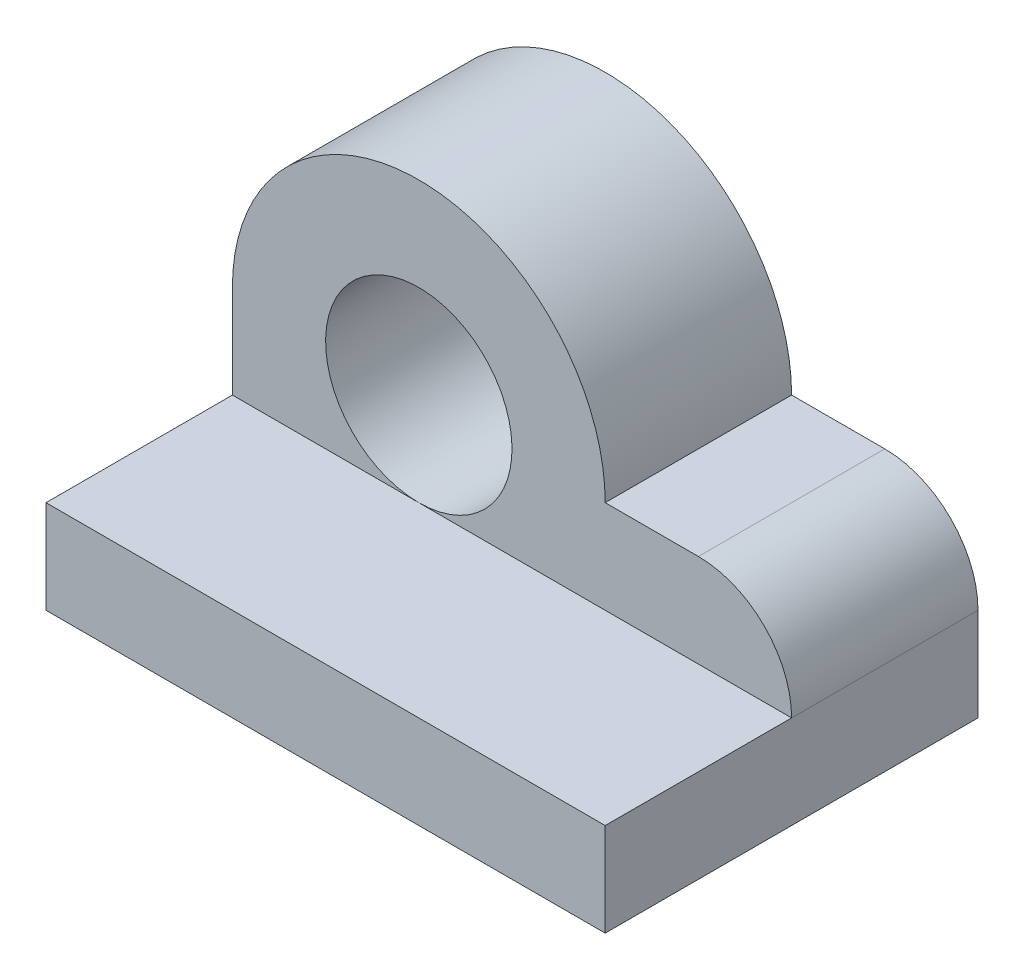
ISO-10303-21;
HEADER;
FILE_DESCRIPTION(('STEP AP214'),'2;1');
FILE_NAME('part.step','',(''),(''),'','','');
FILE_SCHEMA(('AUTOMOTIVE_DESIGN { 1 0 10303 214 1 1 1 1 }'));
ENDSEC;
DATA;
#1=APPLICATION_CONTEXT('core data for automotive mechanical design processes');
#2=APPLICATION_PROTOCOL_DEFINITION('international standard','automotive_design',2000,#1);
#3=PRODUCT_CONTEXT('',#1,'mechanical');
#4=PRODUCT('Part','Part','',(#3));
#5=PRODUCT_RELATED_PRODUCT_CATEGORY('part','',(#4));
#6=PRODUCT_DEFINITION_FORMATION('','',#4);
#7=PRODUCT_DEFINITION_CONTEXT('part definition',#1,'design');
#8=PRODUCT_DEFINITION('design','',#6,#7);
#9=PRODUCT_DEFINITION_SHAPE('','',#8);
#10=(LENGTH_UNIT() NAMED_UNIT(*) SI_UNIT(.MILLI.,.METRE.));
#11=(NAMED_UNIT(*) PLANE_ANGLE_UNIT() SI_UNIT($,.RADIAN.));
#12=(NAMED_UNIT(*) SI_UNIT($,.STERADIAN.) SOLID_ANGLE_UNIT());
#13=UNCERTAINTY_MEASURE_WITH_UNIT(LENGTH_MEASURE(1.E-05),#10,'distance_accuracy_value','');
#14=(GEOMETRIC_REPRESENTATION_CONTEXT(3) GLOBAL_UNCERTAINTY_ASSIGNED_CONTEXT((#13)) GLOBAL_UNIT_ASSIGNED_CONTEXT((#10,
#11,#12)) REPRESENTATION_CONTEXT('',''));
#15=CARTESIAN_POINT('',(0.,0.,0.));
#16=DIRECTION('',(0.,0.,1.));
#17=DIRECTION('',(1.,0.,0.));
#18=AXIS2_PLACEMENT_3D('',#15,#16,#17);
#19=CARTESIAN_POINT('',(7.07106781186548,-63.6653589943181,10.));
#20=DIRECTION('',(0.,0.,1.));
#21=DIRECTION('',(1.,0.,0.));
#22=AXIS2_PLACEMENT_3D('',#19,#20,#21);
#23=PLANE('',#22);
#24=DIRECTION('',(0.,1.,0.));
#25=VECTOR('',#24,1.);
#26=CARTESIAN_POINT('',(-20.,-63.6653589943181,10.));
#27=LINE('',#26,#25);
#28=CARTESIAN_POINT('',(-20.,-10.,10.));
#29=VERTEX_POINT('',#28);
#30=CARTESIAN_POINT('',(-20.,0.,10.));
#31=VERTEX_POINT('',#30);
#32=EDGE_CURVE('E61',#29,#31,#27,.T.);
#33=ORIENTED_EDGE('',*,*,#32,.F.);
#34=DIRECTION('',(1.,0.,0.));
#35=VECTOR('',#34,1.);
#36=CARTESIAN_POINT('',(7.07106781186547,-10.,10.));
#37=LINE('',#36,#35);
#38=CARTESIAN_POINT('',(0.,-10.,10.));
#39=VERTEX_POINT('',#38);
#40=EDGE_CURVE('E13',#29,#39,#37,.T.);
#41=ORIENTED_EDGE('',*,*,#40,.T.);
#42=CARTESIAN_POINT('',(0.,0.,10.));
#43=DIRECTION('',(0.,0.,1.));
#44=DIRECTION('',(1.,0.,0.));
#45=AXIS2_PLACEMENT_3D('',#42,#43,#44);
#46=CIRCLE('',#45,10.);
#47=EDGE_CURVE('E157',#39,#39,#46,.T.);
#48=ORIENTED_EDGE('',*,*,#47,.F.);
#49=CARTESIAN_POINT('',(40.,-10.,10.));
#50=VERTEX_POINT('',#49);
#51=EDGE_CURVE('E48',#39,#50,#37,.T.);
#52=ORIENTED_EDGE('',*,*,#51,.T.);
#53=CARTESIAN_POINT('',(30.,-10.,10.));
#54=DIRECTION('',(0.,0.,1.));
#55=DIRECTION('',(1.,0.,0.));
#56=AXIS2_PLACEMENT_3D('',#53,#54,#55);
#57=CIRCLE('',#56,10.);
#58=CARTESIAN_POINT('',(30.,0.,10.));
#59=VERTEX_POINT('',#58);
#60=EDGE_CURVE('E149',#59,#50,#57,.F.);
#61=ORIENTED_EDGE('',*,*,#60,.F.);
#62=DIRECTION('',(1.,0.,0.));
#63=VECTOR('',#62,1.);
#64=CARTESIAN_POINT('',(7.07106781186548,0.,10.));
#65=LINE('',#64,#63);
#66=CARTESIAN_POINT('',(20.,0.,10.));
#67=VERTEX_POINT('',#66);
#68=EDGE_CURVE('E152',#67,#59,#65,.T.);
#69=ORIENTED_EDGE('',*,*,#68,.F.);
#70=CARTESIAN_POINT('',(0.,0.,10.));
#71=DIRECTION('',(0.,0.,1.));
#72=DIRECTION('',(1.,0.,0.));
#73=AXIS2_PLACEMENT_3D('',#70,#71,#72);
#74=CIRCLE('',#73,20.);
#75=EDGE_CURVE('E155',#67,#31,#74,.T.);
#76=ORIENTED_EDGE('',*,*,#75,.T.);
#77=EDGE_LOOP('',(#33,#41,#48,#52,#61,#69,#76));
#78=FACE_BOUND('',#77,.T.);
#79=ADVANCED_FACE('F44',(#78),#23,.T.);
#80=CARTESIAN_POINT('',(-20.,-63.6653589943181,10.));
#81=DIRECTION('',(-1.,0.,0.));
#82=DIRECTION('',(0.,-1.,0.));
#83=AXIS2_PLACEMENT_3D('',#80,#81,#82);
#84=PLANE('',#83);
#85=DIRECTION('',(0.,0.,-1.));
#86=VECTOR('',#85,1.);
#87=CARTESIAN_POINT('',(-20.,-10.,30.));
#88=LINE('',#87,#86);
#89=CARTESIAN_POINT('',(-20.,-10.,30.));
#90=VERTEX_POINT('',#89);
#91=EDGE_CURVE('E130',#90,#29,#88,.T.);
#92=ORIENTED_EDGE('',*,*,#91,.T.);
#93=ORIENTED_EDGE('',*,*,#32,.T.);
#94=DIRECTION('',(0.,0.,-1.));
#95=VECTOR('',#94,1.);
#96=CARTESIAN_POINT('',(-20.,0.,10.));
#97=LINE('',#96,#95);
#98=CARTESIAN_POINT('',(-20.,0.,-10.));
#99=VERTEX_POINT('',#98);
#100=EDGE_CURVE('E89',#31,#99,#97,.T.);
#101=ORIENTED_EDGE('',*,*,#100,.T.);
#102=DIRECTION('',(0.,1.,0.));
#103=VECTOR('',#102,1.);
#104=CARTESIAN_POINT('',(-20.,-63.6653589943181,-10.));
#105=LINE('',#104,#103);
#106=CARTESIAN_POINT('',(-20.,-20.,-10.));
#107=VERTEX_POINT('',#106);
#108=EDGE_CURVE('E129',#107,#99,#105,.T.);
#109=ORIENTED_EDGE('',*,*,#108,.F.);
#110=DIRECTION('',(0.,0.,-1.));
#111=VECTOR('',#110,1.);
#112=CARTESIAN_POINT('',(-20.,-20.,10.));
#113=LINE('',#112,#111);
#114=CARTESIAN_POINT('',(-20.,-20.,30.));
#115=VERTEX_POINT('',#114);
#116=EDGE_CURVE('E183',#115,#107,#113,.T.);
#117=ORIENTED_EDGE('',*,*,#116,.F.);
#118=DIRECTION('',(0.,1.,0.));
#119=VECTOR('',#118,1.);
#120=CARTESIAN_POINT('',(-20.,-63.6653589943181,30.));
#121=LINE('',#120,#119);
#122=EDGE_CURVE('E138',#115,#90,#121,.T.);
#123=ORIENTED_EDGE('',*,*,#122,.T.);
#124=EDGE_LOOP('',(#92,#93,#101,#109,#117,#123));
#125=FACE_BOUND('',#124,.T.);
#126=ADVANCED_FACE('F46',(#125),#84,.T.);
#127=CARTESIAN_POINT('',(7.07106781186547,-20.,10.));
#128=DIRECTION('',(0.,-1.,0.));
#129=DIRECTION('',(1.,0.,0.));
#130=AXIS2_PLACEMENT_3D('',#127,#128,#129);
#131=PLANE('',#130);
#132=ORIENTED_EDGE('',*,*,#116,.T.);
#133=DIRECTION('',(-1.,0.,0.));
#134=VECTOR('',#133,1.);
#135=CARTESIAN_POINT('',(7.07106781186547,-20.,-10.));
#136=LINE('',#135,#134);
#137=CARTESIAN_POINT('',(40.,-20.,-10.));
#138=VERTEX_POINT('',#137);
#139=EDGE_CURVE('E162',#138,#107,#136,.T.);
#140=ORIENTED_EDGE('',*,*,#139,.F.);
#141=DIRECTION('',(0.,0.,-1.));
#142=VECTOR('',#141,1.);
#143=CARTESIAN_POINT('',(40.,-20.,10.));
#144=LINE('',#143,#142);
#145=CARTESIAN_POINT('',(40.,-20.,30.));
#146=VERTEX_POINT('',#145);
#147=EDGE_CURVE('E182',#146,#138,#144,.T.);
#148=ORIENTED_EDGE('',*,*,#147,.F.);
#149=DIRECTION('',(-1.,0.,0.));
#150=VECTOR('',#149,1.);
#151=CARTESIAN_POINT('',(7.07106781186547,-20.,30.));
#152=LINE('',#151,#150);
#153=EDGE_CURVE('E142',#146,#115,#152,.T.);
#154=ORIENTED_EDGE('',*,*,#153,.T.);
#155=EDGE_LOOP('',(#132,#140,#148,#154));
#156=FACE_BOUND('',#155,.T.);
#157=ADVANCED_FACE('F210',(#156),#131,.T.);
#158=CARTESIAN_POINT('',(40.,-63.6653589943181,10.));
#159=DIRECTION('',(1.,0.,0.));
#160=DIRECTION('',(0.,0.,-1.));
#161=AXIS2_PLACEMENT_3D('',#158,#159,#160);
#162=PLANE('',#161);
#163=ORIENTED_EDGE('',*,*,#147,.T.);
#164=DIRECTION('',(0.,-1.,0.));
#165=VECTOR('',#164,1.);
#166=CARTESIAN_POINT('',(40.,-63.6653589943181,-10.));
#167=LINE('',#166,#165);
#168=CARTESIAN_POINT('',(40.,-10.,-10.));
#169=VERTEX_POINT('',#168);
#170=EDGE_CURVE('E165',#169,#138,#167,.T.);
#171=ORIENTED_EDGE('',*,*,#170,.F.);
#172=DIRECTION('',(0.,0.,-1.));
#173=VECTOR('',#172,1.);
#174=CARTESIAN_POINT('',(40.,-10.,10.));
#175=LINE('',#174,#173);
#176=EDGE_CURVE('E126',#50,#169,#175,.T.);
#177=ORIENTED_EDGE('',*,*,#176,.F.);
#178=DIRECTION('',(0.,0.,-1.));
#179=VECTOR('',#178,1.);
#180=CARTESIAN_POINT('',(40.,-10.,30.));
#181=LINE('',#180,#179);
#182=CARTESIAN_POINT('',(40.,-10.,30.));
#183=VERTEX_POINT('',#182);
#184=EDGE_CURVE('E119',#183,#50,#181,.T.);
#185=ORIENTED_EDGE('',*,*,#184,.F.);
#186=DIRECTION('',(0.,-1.,0.));
#187=VECTOR('',#186,1.);
#188=CARTESIAN_POINT('',(40.,-63.6653589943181,30.));
#189=LINE('',#188,#187);
#190=EDGE_CURVE('E123',#183,#146,#189,.T.);
#191=ORIENTED_EDGE('',*,*,#190,.T.);
#192=EDGE_LOOP('',(#163,#171,#177,#185,#191));
#193=FACE_BOUND('',#192,.T.);
#194=ADVANCED_FACE('F121',(#193),#162,.T.);
#195=CARTESIAN_POINT('',(30.,-10.,10.));
#196=DIRECTION('',(0.,0.,-1.));
#197=DIRECTION('',(-1.,0.,0.));
#198=AXIS2_PLACEMENT_3D('',#195,#196,#197);
#199=CYLINDRICAL_SURFACE('',#198,10.);
#200=CARTESIAN_POINT('',(30.,-10.,-10.));
#201=DIRECTION('',(0.,0.,1.));
#202=DIRECTION('',(1.,0.,0.));
#203=AXIS2_PLACEMENT_3D('',#200,#201,#202);
#204=CIRCLE('',#203,10.);
#205=CARTESIAN_POINT('',(30.,0.,-10.));
#206=VERTEX_POINT('',#205);
#207=EDGE_CURVE('E168',#206,#169,#204,.F.);
#208=ORIENTED_EDGE('',*,*,#207,.F.);
#209=DIRECTION('',(0.,0.,-1.));
#210=VECTOR('',#209,1.);
#211=CARTESIAN_POINT('',(30.,0.,10.));
#212=LINE('',#211,#210);
#213=EDGE_CURVE('E94',#59,#206,#212,.T.);
#214=ORIENTED_EDGE('',*,*,#213,.F.);
#215=ORIENTED_EDGE('',*,*,#60,.T.);
#216=ORIENTED_EDGE('',*,*,#176,.T.);
#217=EDGE_LOOP('',(#208,#214,#215,#216));
#218=FACE_BOUND('',#217,.T.);
#219=ADVANCED_FACE('F234',(#218),#199,.T.);
#220=CARTESIAN_POINT('',(7.07106781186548,0.,10.));
#221=DIRECTION('',(0.,1.,0.));
#222=DIRECTION('',(0.,0.,1.));
#223=AXIS2_PLACEMENT_3D('',#220,#221,#222);
#224=PLANE('',#223);
#225=DIRECTION('',(1.,0.,0.));
#226=VECTOR('',#225,1.);
#227=CARTESIAN_POINT('',(7.07106781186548,0.,-10.));
#228=LINE('',#227,#226);
#229=CARTESIAN_POINT('',(20.,0.,-10.));
#230=VERTEX_POINT('',#229);
#231=EDGE_CURVE('E171',#230,#206,#228,.T.);
#232=ORIENTED_EDGE('',*,*,#231,.F.);
#233=DIRECTION('',(0.,0.,-1.));
#234=VECTOR('',#233,1.);
#235=CARTESIAN_POINT('',(20.,0.,10.));
#236=LINE('',#235,#234);
#237=EDGE_CURVE('E85',#67,#230,#236,.T.);
#238=ORIENTED_EDGE('',*,*,#237,.F.);
#239=ORIENTED_EDGE('',*,*,#68,.T.);
#240=ORIENTED_EDGE('',*,*,#213,.T.);
#241=EDGE_LOOP('',(#232,#238,#239,#240));
#242=FACE_BOUND('',#241,.T.);
#243=ADVANCED_FACE('F239',(#242),#224,.T.);
#244=CARTESIAN_POINT('',(0.,0.,10.));
#245=DIRECTION('',(0.,0.,-1.));
#246=DIRECTION('',(-1.,0.,0.));
#247=AXIS2_PLACEMENT_3D('',#244,#245,#246);
#248=CYLINDRICAL_SURFACE('',#247,20.);
#249=CARTESIAN_POINT('',(0.,0.,-10.));
#250=DIRECTION('',(0.,0.,1.));
#251=DIRECTION('',(1.,0.,0.));
#252=AXIS2_PLACEMENT_3D('',#249,#250,#251);
#253=CIRCLE('',#252,20.);
#254=EDGE_CURVE('E174',#230,#99,#253,.T.);
#255=ORIENTED_EDGE('',*,*,#254,.T.);
#256=ORIENTED_EDGE('',*,*,#100,.F.);
#257=ORIENTED_EDGE('',*,*,#75,.F.);
#258=ORIENTED_EDGE('',*,*,#237,.T.);
#259=EDGE_LOOP('',(#255,#256,#257,#258));
#260=FACE_BOUND('',#259,.T.);
#261=ADVANCED_FACE('F194',(#260),#248,.T.);
#262=CARTESIAN_POINT('',(0.,0.,10.));
#263=DIRECTION('',(0.,0.,-1.));
#264=DIRECTION('',(-1.,0.,0.));
#265=AXIS2_PLACEMENT_3D('',#262,#263,#264);
#266=CYLINDRICAL_SURFACE('',#265,10.);
#267=ORIENTED_EDGE('',*,*,#47,.T.);
#268=EDGE_LOOP('',(#267));
#269=FACE_BOUND('',#268,.T.);
#270=CARTESIAN_POINT('',(0.,0.,-10.));
#271=DIRECTION('',(0.,0.,1.));
#272=DIRECTION('',(1.,0.,0.));
#273=AXIS2_PLACEMENT_3D('',#270,#271,#272);
#274=CIRCLE('',#273,10.);
#275=CARTESIAN_POINT('',(10.,0.,-10.));
#276=VERTEX_POINT('',#275);
#277=EDGE_CURVE('E150',#276,#276,#274,.T.);
#278=ORIENTED_EDGE('',*,*,#277,.F.);
#279=EDGE_LOOP('',(#278));
#280=FACE_BOUND('',#279,.T.);
#281=ADVANCED_FACE('F190',(#269,#280),#266,.F.);
#282=CARTESIAN_POINT('',(7.07106781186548,-63.6653589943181,-10.));
#283=DIRECTION('',(0.,0.,1.));
#284=DIRECTION('',(1.,0.,0.));
#285=AXIS2_PLACEMENT_3D('',#282,#283,#284);
#286=PLANE('',#285);
#287=ORIENTED_EDGE('',*,*,#108,.T.);
#288=ORIENTED_EDGE('',*,*,#254,.F.);
#289=ORIENTED_EDGE('',*,*,#231,.T.);
#290=ORIENTED_EDGE('',*,*,#207,.T.);
#291=ORIENTED_EDGE('',*,*,#170,.T.);
#292=ORIENTED_EDGE('',*,*,#139,.T.);
#293=EDGE_LOOP('',(#287,#288,#289,#290,#291,#292));
#294=FACE_BOUND('',#293,.T.);
#295=ORIENTED_EDGE('',*,*,#277,.T.);
#296=EDGE_LOOP('',(#295));
#297=FACE_BOUND('',#296,.T.);
#298=ADVANCED_FACE('F193',(#294,#297),#286,.F.);
#299=CARTESIAN_POINT('',(7.07106781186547,-10.,30.));
#300=DIRECTION('',(0.,-1.,0.));
#301=DIRECTION('',(1.,0.,0.));
#302=AXIS2_PLACEMENT_3D('',#299,#300,#301);
#303=PLANE('',#302);
#304=ORIENTED_EDGE('',*,*,#40,.F.);
#305=ORIENTED_EDGE('',*,*,#91,.F.);
#306=DIRECTION('',(-1.,0.,0.));
#307=VECTOR('',#306,1.);
#308=CARTESIAN_POINT('',(7.07106781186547,-10.,30.));
#309=LINE('',#308,#307);
#310=EDGE_CURVE('E133',#183,#90,#309,.T.);
#311=ORIENTED_EDGE('',*,*,#310,.F.);
#312=ORIENTED_EDGE('',*,*,#184,.T.);
#313=ORIENTED_EDGE('',*,*,#51,.F.);
#314=EDGE_LOOP('',(#304,#305,#311,#312,#313));
#315=FACE_BOUND('',#314,.T.);
#316=ADVANCED_FACE('F134',(#315),#303,.F.);
#317=CARTESIAN_POINT('',(7.07106781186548,-63.6653589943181,30.));
#318=DIRECTION('',(0.,0.,1.));
#319=DIRECTION('',(1.,0.,0.));
#320=AXIS2_PLACEMENT_3D('',#317,#318,#319);
#321=PLANE('',#320);
#322=ORIENTED_EDGE('',*,*,#190,.F.);
#323=ORIENTED_EDGE('',*,*,#310,.T.);
#324=ORIENTED_EDGE('',*,*,#122,.F.);
#325=ORIENTED_EDGE('',*,*,#153,.F.);
#326=EDGE_LOOP('',(#322,#323,#324,#325));
#327=FACE_BOUND('',#326,.T.);
#328=ADVANCED_FACE('F140',(#327),#321,.T.);
#329=CLOSED_SHELL('',(#79,#126,#157,#194,#219,#243,#261,#281,#298,#316,#328));
#330=MANIFOLD_SOLID_BREP('B2',#329);
#331=ADVANCED_BREP_SHAPE_REPRESENTATION('',(#18,#330),#14);
#332=SHAPE_DEFINITION_REPRESENTATION(#9,#331);
ENDSEC;
END-ISO-10303-21;
